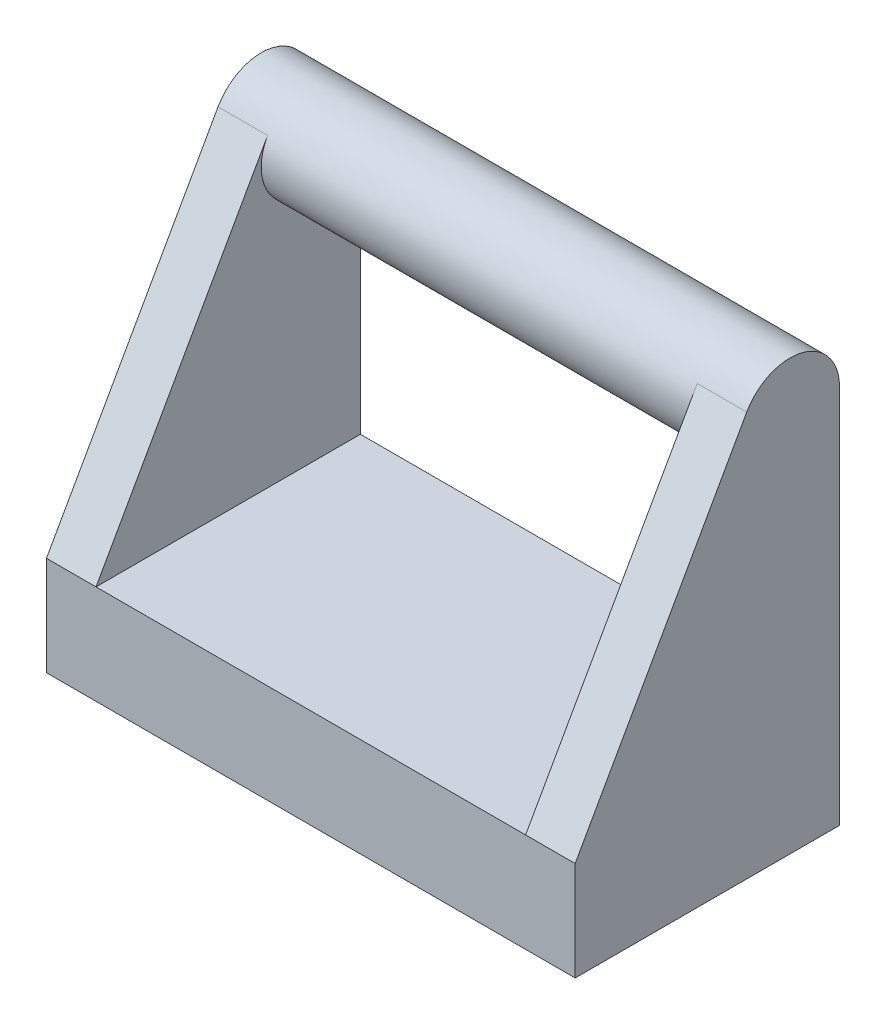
ISO-10303-21;
HEADER;
FILE_DESCRIPTION(('STEP AP214'),'2;1');
FILE_NAME('part.step','',(''),(''),'','','');
FILE_SCHEMA(('AUTOMOTIVE_DESIGN { 1 0 10303 214 1 1 1 1 }'));
ENDSEC;
DATA;
#1=APPLICATION_CONTEXT('core data for automotive mechanical design processes');
#2=APPLICATION_PROTOCOL_DEFINITION('international standard','automotive_design',2000,#1);
#3=PRODUCT_CONTEXT('',#1,'mechanical');
#4=PRODUCT('Part','Part','',(#3));
#5=PRODUCT_RELATED_PRODUCT_CATEGORY('part','',(#4));
#6=PRODUCT_DEFINITION_FORMATION('','',#4);
#7=PRODUCT_DEFINITION_CONTEXT('part definition',#1,'design');
#8=PRODUCT_DEFINITION('design','',#6,#7);
#9=PRODUCT_DEFINITION_SHAPE('','',#8);
#10=(LENGTH_UNIT() NAMED_UNIT(*) SI_UNIT(.MILLI.,.METRE.));
#11=(NAMED_UNIT(*) PLANE_ANGLE_UNIT() SI_UNIT($,.RADIAN.));
#12=(NAMED_UNIT(*) SI_UNIT($,.STERADIAN.) SOLID_ANGLE_UNIT());
#13=UNCERTAINTY_MEASURE_WITH_UNIT(LENGTH_MEASURE(1.E-05),#10,'distance_accuracy_value','');
#14=(GEOMETRIC_REPRESENTATION_CONTEXT(3) GLOBAL_UNCERTAINTY_ASSIGNED_CONTEXT((#13)) GLOBAL_UNIT_ASSIGNED_CONTEXT((#10,
#11,#12)) REPRESENTATION_CONTEXT('',''));
#15=CARTESIAN_POINT('',(0.,0.,0.));
#16=DIRECTION('',(0.,0.,1.));
#17=DIRECTION('',(1.,0.,0.));
#18=AXIS2_PLACEMENT_3D('',#15,#16,#17);
#19=CARTESIAN_POINT('',(0.,0.,8.));
#20=DIRECTION('',(0.,1.,0.));
#21=DIRECTION('',(0.,0.,1.));
#22=AXIS2_PLACEMENT_3D('',#19,#20,#21);
#23=PLANE('',#22);
#24=DIRECTION('',(0.,0.,-1.));
#25=VECTOR('',#24,1.);
#26=CARTESIAN_POINT('',(1.5,0.,8.));
#27=LINE('',#26,#25);
#28=CARTESIAN_POINT('',(1.5,0.,8.));
#29=VERTEX_POINT('',#28);
#30=CARTESIAN_POINT('',(1.5,0.,0.));
#31=VERTEX_POINT('',#30);
#32=EDGE_CURVE('E49',#29,#31,#27,.T.);
#33=ORIENTED_EDGE('',*,*,#32,.F.);
#34=DIRECTION('',(1.,0.,0.));
#35=VECTOR('',#34,1.);
#36=CARTESIAN_POINT('',(0.,0.,8.));
#37=LINE('',#36,#35);
#38=CARTESIAN_POINT('',(14.5,0.,8.));
#39=VERTEX_POINT('',#38);
#40=EDGE_CURVE('E36',#29,#39,#37,.T.);
#41=ORIENTED_EDGE('',*,*,#40,.T.);
#42=DIRECTION('',(0.,0.,-1.));
#43=VECTOR('',#42,1.);
#44=CARTESIAN_POINT('',(14.5,0.,8.));
#45=LINE('',#44,#43);
#46=CARTESIAN_POINT('',(14.5,0.,0.));
#47=VERTEX_POINT('',#46);
#48=EDGE_CURVE('E171',#39,#47,#45,.T.);
#49=ORIENTED_EDGE('',*,*,#48,.T.);
#50=DIRECTION('',(-1.,0.,0.));
#51=VECTOR('',#50,1.);
#52=CARTESIAN_POINT('',(0.,0.,0.));
#53=LINE('',#52,#51);
#54=EDGE_CURVE('E54',#47,#31,#53,.T.);
#55=ORIENTED_EDGE('',*,*,#54,.T.);
#56=EDGE_LOOP('',(#33,#41,#49,#55));
#57=FACE_BOUND('',#56,.T.);
#58=ADVANCED_FACE('F32',(#57),#23,.T.);
#59=CARTESIAN_POINT('',(0.,-1.,8.));
#60=DIRECTION('',(0.,1.,0.));
#61=DIRECTION('',(0.,0.,1.));
#62=AXIS2_PLACEMENT_3D('',#59,#60,#61);
#63=PLANE('',#62);
#64=DIRECTION('',(-1.,0.,0.));
#65=VECTOR('',#64,1.);
#66=CARTESIAN_POINT('',(1.,-1.,7.));
#67=LINE('',#66,#65);
#68=CARTESIAN_POINT('',(15.,-1.,7.));
#69=VERTEX_POINT('',#68);
#70=CARTESIAN_POINT('',(1.,-1.,7.));
#71=VERTEX_POINT('',#70);
#72=EDGE_CURVE('E232',#69,#71,#67,.T.);
#73=ORIENTED_EDGE('',*,*,#72,.T.);
#74=DIRECTION('',(0.,0.,-1.));
#75=VECTOR('',#74,1.);
#76=CARTESIAN_POINT('',(1.,-1.,0.999999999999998));
#77=LINE('',#76,#75);
#78=CARTESIAN_POINT('',(1.,-1.,0.999999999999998));
#79=VERTEX_POINT('',#78);
#80=EDGE_CURVE('E184',#71,#79,#77,.T.);
#81=ORIENTED_EDGE('',*,*,#80,.T.);
#82=DIRECTION('',(1.,0.,0.));
#83=VECTOR('',#82,1.);
#84=CARTESIAN_POINT('',(1.,-1.,0.999999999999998));
#85=LINE('',#84,#83);
#86=CARTESIAN_POINT('',(15.,-1.,0.999999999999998));
#87=VERTEX_POINT('',#86);
#88=EDGE_CURVE('E242',#79,#87,#85,.T.);
#89=ORIENTED_EDGE('',*,*,#88,.T.);
#90=DIRECTION('',(0.,0.,1.));
#91=VECTOR('',#90,1.);
#92=CARTESIAN_POINT('',(15.,-1.,0.999999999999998));
#93=LINE('',#92,#91);
#94=EDGE_CURVE('E245',#87,#69,#93,.T.);
#95=ORIENTED_EDGE('',*,*,#94,.T.);
#96=EDGE_LOOP('',(#73,#81,#89,#95));
#97=FACE_BOUND('',#96,.T.);
#98=CARTESIAN_POINT('',(8.,-1.,4.));
#99=DIRECTION('',(0.,1.,0.));
#100=DIRECTION('',(0.,0.,1.));
#101=AXIS2_PLACEMENT_3D('',#98,#99,#100);
#102=CIRCLE('',#101,1.5);
#103=CARTESIAN_POINT('',(8.,-1.,5.5));
#104=VERTEX_POINT('',#103);
#105=EDGE_CURVE('E193',#104,#104,#102,.F.);
#106=ORIENTED_EDGE('',*,*,#105,.F.);
#107=EDGE_LOOP('',(#106));
#108=FACE_BOUND('',#107,.T.);
#109=ADVANCED_FACE('F283',(#97,#108),#63,.F.);
#110=CARTESIAN_POINT('',(8.,-3.,4.));
#111=DIRECTION('',(0.,-1.,0.));
#112=DIRECTION('',(0.,0.,-1.));
#113=AXIS2_PLACEMENT_3D('',#110,#111,#112);
#114=PLANE('',#113);
#115=CARTESIAN_POINT('',(8.,-3.,4.));
#116=DIRECTION('',(0.,-1.,0.));
#117=DIRECTION('',(0.,0.,-1.));
#118=AXIS2_PLACEMENT_3D('',#115,#116,#117);
#119=CIRCLE('',#118,1.5);
#120=CARTESIAN_POINT('',(8.,-3.,2.5));
#121=VERTEX_POINT('',#120);
#122=EDGE_CURVE('E207',#121,#121,#119,.T.);
#123=ORIENTED_EDGE('',*,*,#122,.T.);
#124=EDGE_LOOP('',(#123));
#125=FACE_BOUND('',#124,.T.);
#126=CARTESIAN_POINT('',(8.,-3.,4.));
#127=DIRECTION('',(0.,-1.,0.));
#128=DIRECTION('',(0.,0.,-1.));
#129=AXIS2_PLACEMENT_3D('',#126,#127,#128);
#130=CIRCLE('',#129,1.);
#131=CARTESIAN_POINT('',(8.,-3.,3.));
#132=VERTEX_POINT('',#131);
#133=EDGE_CURVE('E265',#132,#132,#130,.T.);
#134=ORIENTED_EDGE('',*,*,#133,.F.);
#135=EDGE_LOOP('',(#134));
#136=FACE_BOUND('',#135,.T.);
#137=ADVANCED_FACE('F284',(#125,#136),#114,.T.);
#138=CARTESIAN_POINT('',(8.,-3.,4.));
#139=DIRECTION('',(0.,1.,0.));
#140=DIRECTION('',(0.,0.,1.));
#141=AXIS2_PLACEMENT_3D('',#138,#139,#140);
#142=CYLINDRICAL_SURFACE('',#141,1.5);
#143=ORIENTED_EDGE('',*,*,#122,.F.);
#144=EDGE_LOOP('',(#143));
#145=FACE_BOUND('',#144,.T.);
#146=ORIENTED_EDGE('',*,*,#105,.T.);
#147=EDGE_LOOP('',(#146));
#148=FACE_BOUND('',#147,.T.);
#149=ADVANCED_FACE('F274',(#145,#148),#142,.T.);
#150=CARTESIAN_POINT('',(8.,-3.,4.));
#151=DIRECTION('',(0.,1.,0.));
#152=DIRECTION('',(0.,0.,1.));
#153=AXIS2_PLACEMENT_3D('',#150,#151,#152);
#154=CYLINDRICAL_SURFACE('',#153,1.);
#155=ORIENTED_EDGE('',*,*,#133,.T.);
#156=EDGE_LOOP('',(#155));
#157=FACE_BOUND('',#156,.T.);
#158=CARTESIAN_POINT('',(8.,-1.,4.));
#159=DIRECTION('',(0.,-1.,0.));
#160=DIRECTION('',(0.,0.,-1.));
#161=AXIS2_PLACEMENT_3D('',#158,#159,#160);
#162=CIRCLE('',#161,1.);
#163=CARTESIAN_POINT('',(8.,-1.,3.));
#164=VERTEX_POINT('',#163);
#165=EDGE_CURVE('E264',#164,#164,#162,.T.);
#166=ORIENTED_EDGE('',*,*,#165,.F.);
#167=EDGE_LOOP('',(#166));
#168=FACE_BOUND('',#167,.T.);
#169=ADVANCED_FACE('F272',(#157,#168),#154,.F.);
#170=ORIENTED_EDGE('',*,*,#165,.T.);
#171=EDGE_LOOP('',(#170));
#172=FACE_BOUND('',#171,.T.);
#173=ADVANCED_FACE('F270',(#172),#63,.F.);
#174=CARTESIAN_POINT('',(16.,-3.,0.));
#175=DIRECTION('',(0.,1.,0.));
#176=DIRECTION('',(0.,0.,1.));
#177=AXIS2_PLACEMENT_3D('',#174,#175,#176);
#178=PLANE('',#177);
#179=DIRECTION('',(0.,0.,1.));
#180=VECTOR('',#179,1.);
#181=CARTESIAN_POINT('',(16.,-3.,8.));
#182=LINE('',#181,#180);
#183=CARTESIAN_POINT('',(16.,-3.,0.));
#184=VERTEX_POINT('',#183);
#185=CARTESIAN_POINT('',(16.,-3.,8.));
#186=VERTEX_POINT('',#185);
#187=EDGE_CURVE('E219',#184,#186,#182,.T.);
#188=ORIENTED_EDGE('',*,*,#187,.T.);
#189=DIRECTION('',(-1.,0.,0.));
#190=VECTOR('',#189,1.);
#191=CARTESIAN_POINT('',(16.,-3.,8.));
#192=LINE('',#191,#190);
#193=CARTESIAN_POINT('',(0.,-3.,8.));
#194=VERTEX_POINT('',#193);
#195=EDGE_CURVE('E213',#186,#194,#192,.T.);
#196=ORIENTED_EDGE('',*,*,#195,.T.);
#197=DIRECTION('',(0.,0.,-1.));
#198=VECTOR('',#197,1.);
#199=CARTESIAN_POINT('',(0.,-3.,8.));
#200=LINE('',#199,#198);
#201=CARTESIAN_POINT('',(0.,-3.,0.));
#202=VERTEX_POINT('',#201);
#203=EDGE_CURVE('E146',#194,#202,#200,.T.);
#204=ORIENTED_EDGE('',*,*,#203,.T.);
#205=DIRECTION('',(1.,0.,0.));
#206=VECTOR('',#205,1.);
#207=CARTESIAN_POINT('',(16.,-3.,0.));
#208=LINE('',#207,#206);
#209=EDGE_CURVE('E261',#202,#184,#208,.T.);
#210=ORIENTED_EDGE('',*,*,#209,.T.);
#211=EDGE_LOOP('',(#188,#196,#204,#210));
#212=FACE_BOUND('',#211,.T.);
#213=DIRECTION('',(0.,0.,-1.));
#214=VECTOR('',#213,1.);
#215=CARTESIAN_POINT('',(1.,-3.,0.999999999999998));
#216=LINE('',#215,#214);
#217=CARTESIAN_POINT('',(1.,-3.,7.));
#218=VERTEX_POINT('',#217);
#219=CARTESIAN_POINT('',(1.,-3.,0.999999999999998));
#220=VERTEX_POINT('',#219);
#221=EDGE_CURVE('E229',#218,#220,#216,.T.);
#222=ORIENTED_EDGE('',*,*,#221,.F.);
#223=DIRECTION('',(-1.,0.,0.));
#224=VECTOR('',#223,1.);
#225=CARTESIAN_POINT('',(1.,-3.,7.));
#226=LINE('',#225,#224);
#227=CARTESIAN_POINT('',(15.,-3.,7.));
#228=VERTEX_POINT('',#227);
#229=EDGE_CURVE('E237',#228,#218,#226,.T.);
#230=ORIENTED_EDGE('',*,*,#229,.F.);
#231=DIRECTION('',(0.,0.,1.));
#232=VECTOR('',#231,1.);
#233=CARTESIAN_POINT('',(15.,-3.,0.999999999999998));
#234=LINE('',#233,#232);
#235=CARTESIAN_POINT('',(15.,-3.,0.999999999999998));
#236=VERTEX_POINT('',#235);
#237=EDGE_CURVE('E234',#236,#228,#234,.T.);
#238=ORIENTED_EDGE('',*,*,#237,.F.);
#239=DIRECTION('',(1.,0.,0.));
#240=VECTOR('',#239,1.);
#241=CARTESIAN_POINT('',(1.,-3.,0.999999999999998));
#242=LINE('',#241,#240);
#243=EDGE_CURVE('E231',#220,#236,#242,.T.);
#244=ORIENTED_EDGE('',*,*,#243,.F.);
#245=EDGE_LOOP('',(#222,#230,#238,#244));
#246=FACE_BOUND('',#245,.T.);
#247=ADVANCED_FACE('F281',(#212,#246),#178,.F.);
#248=CARTESIAN_POINT('',(1.,-3.,0.999999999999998));
#249=DIRECTION('',(1.,0.,0.));
#250=DIRECTION('',(0.,0.,-1.));
#251=AXIS2_PLACEMENT_3D('',#248,#249,#250);
#252=PLANE('',#251);
#253=ORIENTED_EDGE('',*,*,#80,.F.);
#254=DIRECTION('',(0.,1.,0.));
#255=VECTOR('',#254,1.);
#256=CARTESIAN_POINT('',(1.,-3.,7.));
#257=LINE('',#256,#255);
#258=EDGE_CURVE('E239',#218,#71,#257,.T.);
#259=ORIENTED_EDGE('',*,*,#258,.F.);
#260=ORIENTED_EDGE('',*,*,#221,.T.);
#261=DIRECTION('',(0.,1.,0.));
#262=VECTOR('',#261,1.);
#263=CARTESIAN_POINT('',(1.,-3.,0.999999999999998));
#264=LINE('',#263,#262);
#265=EDGE_CURVE('E255',#220,#79,#264,.T.);
#266=ORIENTED_EDGE('',*,*,#265,.T.);
#267=EDGE_LOOP('',(#253,#259,#260,#266));
#268=FACE_BOUND('',#267,.T.);
#269=ADVANCED_FACE('F322',(#268),#252,.T.);
#270=CARTESIAN_POINT('',(1.,-3.,0.999999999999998));
#271=DIRECTION('',(0.,0.,1.));
#272=DIRECTION('',(1.,0.,0.));
#273=AXIS2_PLACEMENT_3D('',#270,#271,#272);
#274=PLANE('',#273);
#275=ORIENTED_EDGE('',*,*,#88,.F.);
#276=ORIENTED_EDGE('',*,*,#265,.F.);
#277=ORIENTED_EDGE('',*,*,#243,.T.);
#278=DIRECTION('',(0.,1.,0.));
#279=VECTOR('',#278,1.);
#280=CARTESIAN_POINT('',(15.,-3.,0.999999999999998));
#281=LINE('',#280,#279);
#282=EDGE_CURVE('E253',#236,#87,#281,.T.);
#283=ORIENTED_EDGE('',*,*,#282,.T.);
#284=EDGE_LOOP('',(#275,#276,#277,#283));
#285=FACE_BOUND('',#284,.T.);
#286=ADVANCED_FACE('F312',(#285),#274,.T.);
#287=CARTESIAN_POINT('',(15.,-3.,0.999999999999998));
#288=DIRECTION('',(-1.,0.,0.));
#289=DIRECTION('',(0.,0.,1.));
#290=AXIS2_PLACEMENT_3D('',#287,#288,#289);
#291=PLANE('',#290);
#292=ORIENTED_EDGE('',*,*,#94,.F.);
#293=ORIENTED_EDGE('',*,*,#282,.F.);
#294=ORIENTED_EDGE('',*,*,#237,.T.);
#295=DIRECTION('',(0.,1.,0.));
#296=VECTOR('',#295,1.);
#297=CARTESIAN_POINT('',(15.,-3.,7.));
#298=LINE('',#297,#296);
#299=EDGE_CURVE('E251',#228,#69,#298,.T.);
#300=ORIENTED_EDGE('',*,*,#299,.T.);
#301=EDGE_LOOP('',(#292,#293,#294,#300));
#302=FACE_BOUND('',#301,.T.);
#303=ADVANCED_FACE('F306',(#302),#291,.T.);
#304=CARTESIAN_POINT('',(1.,-3.,7.));
#305=DIRECTION('',(0.,0.,-1.));
#306=DIRECTION('',(-1.,0.,0.));
#307=AXIS2_PLACEMENT_3D('',#304,#305,#306);
#308=PLANE('',#307);
#309=ORIENTED_EDGE('',*,*,#72,.F.);
#310=ORIENTED_EDGE('',*,*,#299,.F.);
#311=ORIENTED_EDGE('',*,*,#229,.T.);
#312=ORIENTED_EDGE('',*,*,#258,.T.);
#313=EDGE_LOOP('',(#309,#310,#311,#312));
#314=FACE_BOUND('',#313,.T.);
#315=ADVANCED_FACE('F302',(#314),#308,.T.);
#316=CARTESIAN_POINT('',(0.,-1.,8.));
#317=DIRECTION('',(0.,0.,1.));
#318=DIRECTION('',(1.,0.,0.));
#319=AXIS2_PLACEMENT_3D('',#316,#317,#318);
#320=PLANE('',#319);
#321=CARTESIAN_POINT('',(0.,0.,8.));
#322=VERTEX_POINT('',#321);
#323=EDGE_CURVE('E128',#322,#29,#37,.T.);
#324=ORIENTED_EDGE('',*,*,#323,.F.);
#325=DIRECTION('',(0.,1.,0.));
#326=VECTOR('',#325,1.);
#327=CARTESIAN_POINT('',(0.,-1.,8.));
#328=LINE('',#327,#326);
#329=EDGE_CURVE('E132',#194,#322,#328,.T.);
#330=ORIENTED_EDGE('',*,*,#329,.F.);
#331=ORIENTED_EDGE('',*,*,#195,.F.);
#332=DIRECTION('',(0.,1.,0.));
#333=VECTOR('',#332,1.);
#334=CARTESIAN_POINT('',(16.,-1.,8.));
#335=LINE('',#334,#333);
#336=CARTESIAN_POINT('',(16.,0.,8.));
#337=VERTEX_POINT('',#336);
#338=EDGE_CURVE('E147',#186,#337,#335,.T.);
#339=ORIENTED_EDGE('',*,*,#338,.T.);
#340=DIRECTION('',(1.,0.,0.));
#341=VECTOR('',#340,1.);
#342=CARTESIAN_POINT('',(14.5,0.,8.));
#343=LINE('',#342,#341);
#344=EDGE_CURVE('E182',#39,#337,#343,.T.);
#345=ORIENTED_EDGE('',*,*,#344,.F.);
#346=ORIENTED_EDGE('',*,*,#40,.F.);
#347=EDGE_LOOP('',(#324,#330,#331,#339,#345,#346));
#348=FACE_BOUND('',#347,.T.);
#349=ADVANCED_FACE('F130',(#348),#320,.T.);
#350=CARTESIAN_POINT('',(16.,-1.,0.));
#351=DIRECTION('',(1.,0.,0.));
#352=DIRECTION('',(0.,0.,-1.));
#353=AXIS2_PLACEMENT_3D('',#350,#351,#352);
#354=PLANE('',#353);
#355=DIRECTION('',(0.,1.,0.));
#356=VECTOR('',#355,1.);
#357=CARTESIAN_POINT('',(16.,-1.,0.));
#358=LINE('',#357,#356);
#359=CARTESIAN_POINT('',(16.,8.50000000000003,0.));
#360=VERTEX_POINT('',#359);
#361=EDGE_CURVE('E202',#184,#360,#358,.T.);
#362=ORIENTED_EDGE('',*,*,#361,.T.);
#363=CARTESIAN_POINT('',(16.,8.5,1.5));
#364=DIRECTION('',(1.,0.,0.));
#365=DIRECTION('',(0.,0.,-1.));
#366=AXIS2_PLACEMENT_3D('',#363,#364,#365);
#367=CIRCLE('',#366,1.5);
#368=CARTESIAN_POINT('',(16.,9.23514758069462,2.8075006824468));
#369=VERTEX_POINT('',#368);
#370=EDGE_CURVE('E166',#360,#369,#367,.T.);
#371=ORIENTED_EDGE('',*,*,#370,.T.);
#372=DIRECTION('',(0.,-0.871667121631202,0.490098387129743));
#373=VECTOR('',#372,1.);
#374=CARTESIAN_POINT('',(16.,0.,8.));
#375=LINE('',#374,#373);
#376=EDGE_CURVE('E175',#369,#337,#375,.T.);
#377=ORIENTED_EDGE('',*,*,#376,.T.);
#378=ORIENTED_EDGE('',*,*,#338,.F.);
#379=ORIENTED_EDGE('',*,*,#187,.F.);
#380=EDGE_LOOP('',(#362,#371,#377,#378,#379));
#381=FACE_BOUND('',#380,.T.);
#382=ADVANCED_FACE('F218',(#381),#354,.T.);
#383=CARTESIAN_POINT('',(0.,-1.,0.));
#384=DIRECTION('',(0.,0.,-1.));
#385=DIRECTION('',(-1.,0.,0.));
#386=AXIS2_PLACEMENT_3D('',#383,#384,#385);
#387=PLANE('',#386);
#388=ORIENTED_EDGE('',*,*,#54,.F.);
#389=DIRECTION('',(0.,1.,0.));
#390=VECTOR('',#389,1.);
#391=CARTESIAN_POINT('',(14.5,0.,0.));
#392=LINE('',#391,#390);
#393=CARTESIAN_POINT('',(14.5,8.50000000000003,0.));
#394=VERTEX_POINT('',#393);
#395=EDGE_CURVE('E174',#47,#394,#392,.T.);
#396=ORIENTED_EDGE('',*,*,#395,.T.);
#397=DIRECTION('',(1.,0.,0.));
#398=VECTOR('',#397,1.);
#399=CARTESIAN_POINT('',(14.5,8.50000000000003,0.));
#400=LINE('',#399,#398);
#401=EDGE_CURVE('E190',#394,#360,#400,.T.);
#402=ORIENTED_EDGE('',*,*,#401,.T.);
#403=ORIENTED_EDGE('',*,*,#361,.F.);
#404=ORIENTED_EDGE('',*,*,#209,.F.);
#405=DIRECTION('',(0.,1.,0.));
#406=VECTOR('',#405,1.);
#407=CARTESIAN_POINT('',(0.,-1.,0.));
#408=LINE('',#407,#406);
#409=CARTESIAN_POINT('',(0.,8.5,0.));
#410=VERTEX_POINT('',#409);
#411=EDGE_CURVE('E198',#202,#410,#408,.T.);
#412=ORIENTED_EDGE('',*,*,#411,.T.);
#413=DIRECTION('',(1.,0.,0.));
#414=VECTOR('',#413,1.);
#415=CARTESIAN_POINT('',(0.,8.50000000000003,0.));
#416=LINE('',#415,#414);
#417=CARTESIAN_POINT('',(1.5,8.5,0.));
#418=VERTEX_POINT('',#417);
#419=EDGE_CURVE('E152',#410,#418,#416,.T.);
#420=ORIENTED_EDGE('',*,*,#419,.T.);
#421=DIRECTION('',(0.,1.,0.));
#422=VECTOR('',#421,1.);
#423=CARTESIAN_POINT('',(1.5,0.,0.));
#424=LINE('',#423,#422);
#425=EDGE_CURVE('E157',#31,#418,#424,.T.);
#426=ORIENTED_EDGE('',*,*,#425,.F.);
#427=EDGE_LOOP('',(#388,#396,#402,#403,#404,#412,#420,#426));
#428=FACE_BOUND('',#427,.T.);
#429=ADVANCED_FACE('F296',(#428),#387,.T.);
#430=CARTESIAN_POINT('',(0.,-1.,0.));
#431=DIRECTION('',(-1.,0.,0.));
#432=DIRECTION('',(0.,0.,1.));
#433=AXIS2_PLACEMENT_3D('',#430,#431,#432);
#434=PLANE('',#433);
#435=ORIENTED_EDGE('',*,*,#329,.T.);
#436=DIRECTION('',(0.,-0.871667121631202,0.490098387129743));
#437=VECTOR('',#436,1.);
#438=CARTESIAN_POINT('',(0.,0.,8.));
#439=LINE('',#438,#437);
#440=CARTESIAN_POINT('',(0.,9.23514758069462,2.8075006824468));
#441=VERTEX_POINT('',#440);
#442=EDGE_CURVE('E144',#441,#322,#439,.T.);
#443=ORIENTED_EDGE('',*,*,#442,.F.);
#444=CARTESIAN_POINT('',(0.,8.5,1.5));
#445=DIRECTION('',(1.,0.,0.));
#446=DIRECTION('',(0.,0.,-1.));
#447=AXIS2_PLACEMENT_3D('',#444,#445,#446);
#448=CIRCLE('',#447,1.5);
#449=EDGE_CURVE('E163',#410,#441,#448,.T.);
#450=ORIENTED_EDGE('',*,*,#449,.F.);
#451=ORIENTED_EDGE('',*,*,#411,.F.);
#452=ORIENTED_EDGE('',*,*,#203,.F.);
#453=EDGE_LOOP('',(#435,#443,#450,#451,#452));
#454=FACE_BOUND('',#453,.T.);
#455=ADVANCED_FACE('F34',(#454),#434,.T.);
#456=CARTESIAN_POINT('',(14.5,0.,8.));
#457=DIRECTION('',(0.,0.490098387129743,0.871667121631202));
#458=DIRECTION('',(0.,-0.871667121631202,0.490098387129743));
#459=AXIS2_PLACEMENT_3D('',#456,#457,#458);
#460=PLANE('',#459);
#461=ORIENTED_EDGE('',*,*,#376,.F.);
#462=DIRECTION('',(1.,0.,0.));
#463=VECTOR('',#462,1.);
#464=CARTESIAN_POINT('',(14.5,9.23514758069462,2.8075006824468));
#465=LINE('',#464,#463);
#466=CARTESIAN_POINT('',(14.5,9.23514758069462,2.8075006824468));
#467=VERTEX_POINT('',#466);
#468=EDGE_CURVE('E185',#467,#369,#465,.T.);
#469=ORIENTED_EDGE('',*,*,#468,.F.);
#470=DIRECTION('',(0.,-0.871667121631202,0.490098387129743));
#471=VECTOR('',#470,1.);
#472=CARTESIAN_POINT('',(14.5,0.,8.));
#473=LINE('',#472,#471);
#474=EDGE_CURVE('E179',#467,#39,#473,.T.);
#475=ORIENTED_EDGE('',*,*,#474,.T.);
#476=ORIENTED_EDGE('',*,*,#344,.T.);
#477=EDGE_LOOP('',(#461,#469,#475,#476));
#478=FACE_BOUND('',#477,.T.);
#479=ADVANCED_FACE('F344',(#478),#460,.T.);
#480=CARTESIAN_POINT('',(14.5,8.5,1.5));
#481=DIRECTION('',(1.,0.,0.));
#482=DIRECTION('',(0.,0.,-1.));
#483=AXIS2_PLACEMENT_3D('',#480,#481,#482);
#484=CYLINDRICAL_SURFACE('',#483,1.5);
#485=CARTESIAN_POINT('',(1.5,8.5,1.5));
#486=DIRECTION('',(1.,0.,0.));
#487=DIRECTION('',(0.,0.,-1.));
#488=AXIS2_PLACEMENT_3D('',#485,#486,#487);
#489=CIRCLE('',#488,1.5);
#490=CARTESIAN_POINT('',(1.5,9.23514758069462,2.8075006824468));
#491=VERTEX_POINT('',#490);
#492=EDGE_CURVE('E11',#418,#491,#489,.F.);
#493=ORIENTED_EDGE('',*,*,#492,.F.);
#494=ORIENTED_EDGE('',*,*,#419,.F.);
#495=ORIENTED_EDGE('',*,*,#449,.T.);
#496=DIRECTION('',(1.,0.,0.));
#497=VECTOR('',#496,1.);
#498=CARTESIAN_POINT('',(0.,9.23514758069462,2.8075006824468));
#499=LINE('',#498,#497);
#500=EDGE_CURVE('E151',#441,#491,#499,.T.);
#501=ORIENTED_EDGE('',*,*,#500,.T.);
#502=EDGE_LOOP('',(#493,#494,#495,#501));
#503=FACE_BOUND('',#502,.T.);
#504=ORIENTED_EDGE('',*,*,#370,.F.);
#505=ORIENTED_EDGE('',*,*,#401,.F.);
#506=CARTESIAN_POINT('',(14.5,8.5,1.5));
#507=DIRECTION('',(1.,0.,0.));
#508=DIRECTION('',(0.,0.,-1.));
#509=AXIS2_PLACEMENT_3D('',#506,#507,#508);
#510=CIRCLE('',#509,1.5);
#511=EDGE_CURVE('E42',#467,#394,#510,.T.);
#512=ORIENTED_EDGE('',*,*,#511,.F.);
#513=ORIENTED_EDGE('',*,*,#468,.T.);
#514=EDGE_LOOP('',(#504,#505,#512,#513));
#515=FACE_BOUND('',#514,.T.);
#516=ADVANCED_FACE('F317',(#503,#515),#484,.T.);
#517=CARTESIAN_POINT('',(14.5,8.5,1.5));
#518=DIRECTION('',(1.,0.,0.));
#519=DIRECTION('',(0.,0.,-1.));
#520=AXIS2_PLACEMENT_3D('',#517,#518,#519);
#521=PLANE('',#520);
#522=ORIENTED_EDGE('',*,*,#474,.F.);
#523=ORIENTED_EDGE('',*,*,#511,.T.);
#524=ORIENTED_EDGE('',*,*,#395,.F.);
#525=ORIENTED_EDGE('',*,*,#48,.F.);
#526=EDGE_LOOP('',(#522,#523,#524,#525));
#527=FACE_BOUND('',#526,.T.);
#528=ADVANCED_FACE('F346',(#527),#521,.F.);
#529=CARTESIAN_POINT('',(0.,0.,8.));
#530=DIRECTION('',(0.,0.490098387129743,0.871667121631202));
#531=DIRECTION('',(0.,-0.871667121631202,0.490098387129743));
#532=AXIS2_PLACEMENT_3D('',#529,#530,#531);
#533=PLANE('',#532);
#534=DIRECTION('',(0.,-0.871667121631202,0.490098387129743));
#535=VECTOR('',#534,1.);
#536=CARTESIAN_POINT('',(1.5,0.,8.));
#537=LINE('',#536,#535);
#538=EDGE_CURVE('E153',#491,#29,#537,.T.);
#539=ORIENTED_EDGE('',*,*,#538,.F.);
#540=ORIENTED_EDGE('',*,*,#500,.F.);
#541=ORIENTED_EDGE('',*,*,#442,.T.);
#542=ORIENTED_EDGE('',*,*,#323,.T.);
#543=EDGE_LOOP('',(#539,#540,#541,#542));
#544=FACE_BOUND('',#543,.T.);
#545=ADVANCED_FACE('F150',(#544),#533,.T.);
#546=CARTESIAN_POINT('',(1.5,8.5,1.5));
#547=DIRECTION('',(1.,0.,0.));
#548=DIRECTION('',(0.,0.,-1.));
#549=AXIS2_PLACEMENT_3D('',#546,#547,#548);
#550=PLANE('',#549);
#551=ORIENTED_EDGE('',*,*,#425,.T.);
#552=ORIENTED_EDGE('',*,*,#492,.T.);
#553=ORIENTED_EDGE('',*,*,#538,.T.);
#554=ORIENTED_EDGE('',*,*,#32,.T.);
#555=EDGE_LOOP('',(#551,#552,#553,#554));
#556=FACE_BOUND('',#555,.T.);
#557=ADVANCED_FACE('F348',(#556),#550,.T.);
#558=CLOSED_SHELL('',(#58,#109,#137,#149,#169,#173,#247,#269,#286,#303,#315,#349,#382,#429,#455,
#479,#516,#528,#545,#557));
#559=MANIFOLD_SOLID_BREP('B2',#558);
#560=ADVANCED_BREP_SHAPE_REPRESENTATION('',(#18,#559),#14);
#561=SHAPE_DEFINITION_REPRESENTATION(#9,#560);
ENDSEC;
END-ISO-10303-21;
